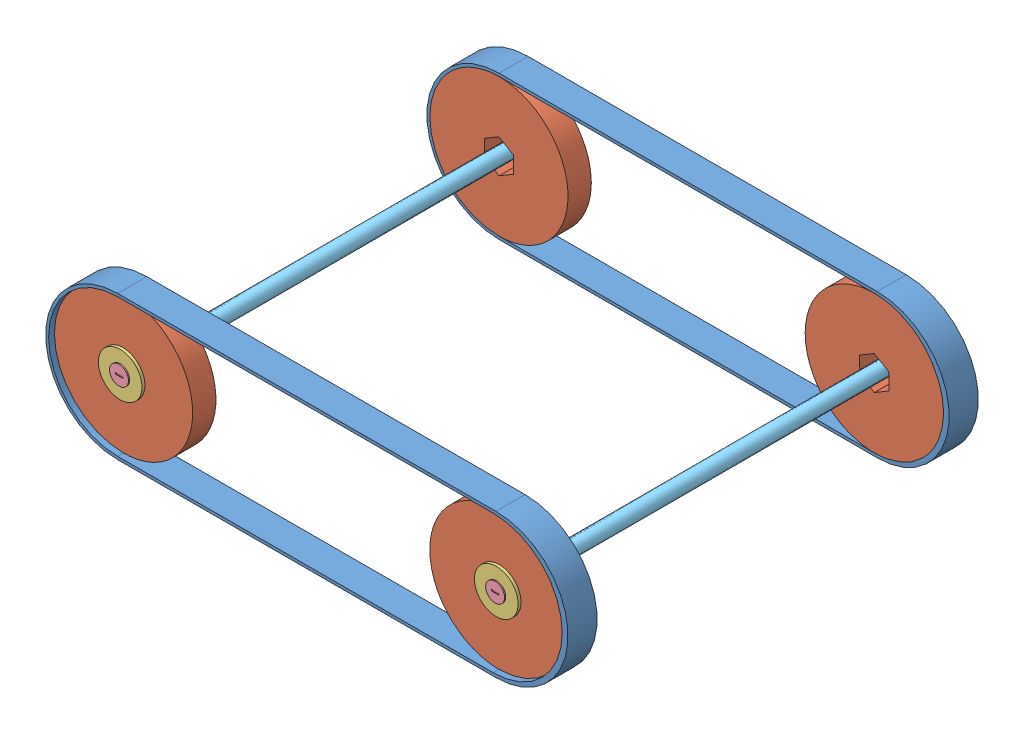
SolidWorks assembly Finished treads with axle.SLDASM, configuration Default (file format 14000). Lengths in mm.
Overall size (228.03 63.11 179.07).
18 component instances, 5 part files, 7 mates.
Components (placement in the parent):
- WheelTreads W screws-1: WheelTreads W screws.SLDASM [Default] at (69.0449 119.2746 183.2405) size (227.97 62.87 20.76)
  - RMPTread1-1: RMPTread1.SLDPRT [Default] at (82.774 182.8334 215.74) size (227.97 62.87 12.7)
  - RMPWheel1-1: RMPWheel1.SLDPRT [Default] at (82.774 182.8334 218.28) size (60.32 60.32 10.16)
  - RMPWheel1-2: RMPWheel1.SLDPRT [Default] at (246.604 182.8334 218.28) size (60.32 60.32 10.16)
  - washer 3-4 OD 1-8 ID-1: washer 3-4 OD 1-8 ID.SLDPRT [Default] at (246.7243 182.8785 217.01) x (0.999888 0.014951 0) z (0.014951 -0.999888 0) size (19.05 1.27 19.05)
  - washer 3-4 OD 1-8 ID-2: washer 3-4 OD 1-8 ID.SLDPRT [Default] at (82.5739 182.7908 217.01) x (1 0 0) z (0 -1 0) size (19.05 1.27 19.05)
  - Screw 1-8in ID .75in length-3: Screw 1-8in ID .75in length.SLDPRT [Default] at (245.1368 182.8785 236.5) x (0 0 1) z (-1 0 0) size (20 8.26 8.26)
  - Screw 1-8in ID .75in length-4: Screw 1-8in ID .75in length.SLDPRT [Default] at (80.9864 182.7908 236.5) x (0 0 1) z (-1 0 0) size (20 8.26 8.26)
- WheelTreads W screws-2: WheelTreads W screws.SLDASM [Default] at (68.8498 484.768 793.7905) x (0.999999 0.001068 0) z (0 0 -1) size (227.97 62.87 20.76)
  - RMPTread1-1: RMPTread1.SLDPRT [Default] at (82.774 182.8334 215.74) size (227.97 62.87 12.7)
  - RMPWheel1-1: RMPWheel1.SLDPRT [Default] at (82.774 182.8334 218.28) size (60.32 60.32 10.16)
  - RMPWheel1-2: RMPWheel1.SLDPRT [Default] at (246.604 182.8334 218.28) size (60.32 60.32 10.16)
  - washer 3-4 OD 1-8 ID-1: washer 3-4 OD 1-8 ID.SLDPRT [Default] at (246.7243 182.8785 217.01) x (0.999888 0.014951 0) z (0.014951 -0.999888 0) size (19.05 1.27 19.05)
  - washer 3-4 OD 1-8 ID-2: washer 3-4 OD 1-8 ID.SLDPRT [Default] at (82.5739 182.7908 217.01) x (1 0 0) z (0 -1 0) size (19.05 1.27 19.05)
  - Screw 1-8in ID .75in length-3: Screw 1-8in ID .75in length.SLDPRT [Default] at (245.1368 182.8785 236.5) x (0 0 1) z (-1 0 0) size (20 8.26 8.26)
  - Screw 1-8in ID .75in length-4: Screw 1-8in ID .75in length.SLDPRT [Default] at (80.9864 182.7908 236.5) x (0 0 1) z (-1 0 0) size (20 8.26 8.26)
- Axle-1: Axle.SLDPRT [Default] at (312.8364 300.9369 576.7805) x (0 0 1) z (-0.923728 -0.383049 0) size (172.72 6.35 6.35)
- Axle-2: Axle.SLDPRT [Default] at (148.686 300.8492 576.7805) x (0 0 1) z (-0.923728 -0.383049 0) size (172.72 6.35 6.35)
Mates (geometry in assembly coordinates):
- Concentric1: concentric anti-aligned: cylinder of WheelTreads W screws-2/Screw 1-8in ID .75in length-4 through (151.6188 302.0654 576.8239) axis (0 0 -1) radius 1.5875; cylinder of Axle-2 through (151.6188 302.0654 596.3139) axis (0 0 1) radius 1.5875
- Coincident1: coincident anti-aligned: plane of WheelTreads W screws-2/Screw 1-8in ID .75in length-4 through (150.0313 302.0637 596.3139) normal (0 0 -1); plane of Axle-2 through (148.686 300.8492 596.3139) normal (0 0 1)
- Concentric2: concentric anti-aligned: cylinder of WheelTreads W screws-2/Screw 1-8in ID .75in length-3 through (315.7692 302.1531 576.8239) axis (0 0 -1) radius 1.5875; cylinder of Axle-1 through (315.7692 302.1531 596.3139) axis (0 0 1) radius 1.5875
- Coincident2: coincident anti-aligned: plane of WheelTreads W screws-2/Screw 1-8in ID .75in length-3 through (314.1817 302.1514 596.3139) normal (0 0 -1); plane of Axle-1 through (312.8364 300.9369 596.3139) normal (0 0 1)
- Concentric6: concentric anti-aligned: cylinder of WheelTreads W screws-1/Screw 1-8in ID .75in length-3 through (315.7692 302.1531 419.7405) axis (0 0 1) radius 1.5875; cylinder of Axle-1 through (315.7692 302.1531 423.5939) axis (0 0 -1) radius 1.5875
- Concentric7: concentric anti-aligned: cylinder of WheelTreads W screws-1/Screw 1-8in ID .75in length-4 through (151.6188 302.0654 419.7405) axis (0 0 1) radius 1.5875; cylinder of Axle-2 through (151.6188 302.0654 404.0605) axis (0 0 -1) radius 1.5875
- Distance1: distance = 2.54 mm anti-aligned: plane of Axle-2 through (148.686 300.8492 404.0605) normal (0 0 -1); plane of WheelTreads W screws-1/washer 3-4 OD 1-8 ID-2 through (151.6188 302.0654 401.5205) normal (0 0 1)
